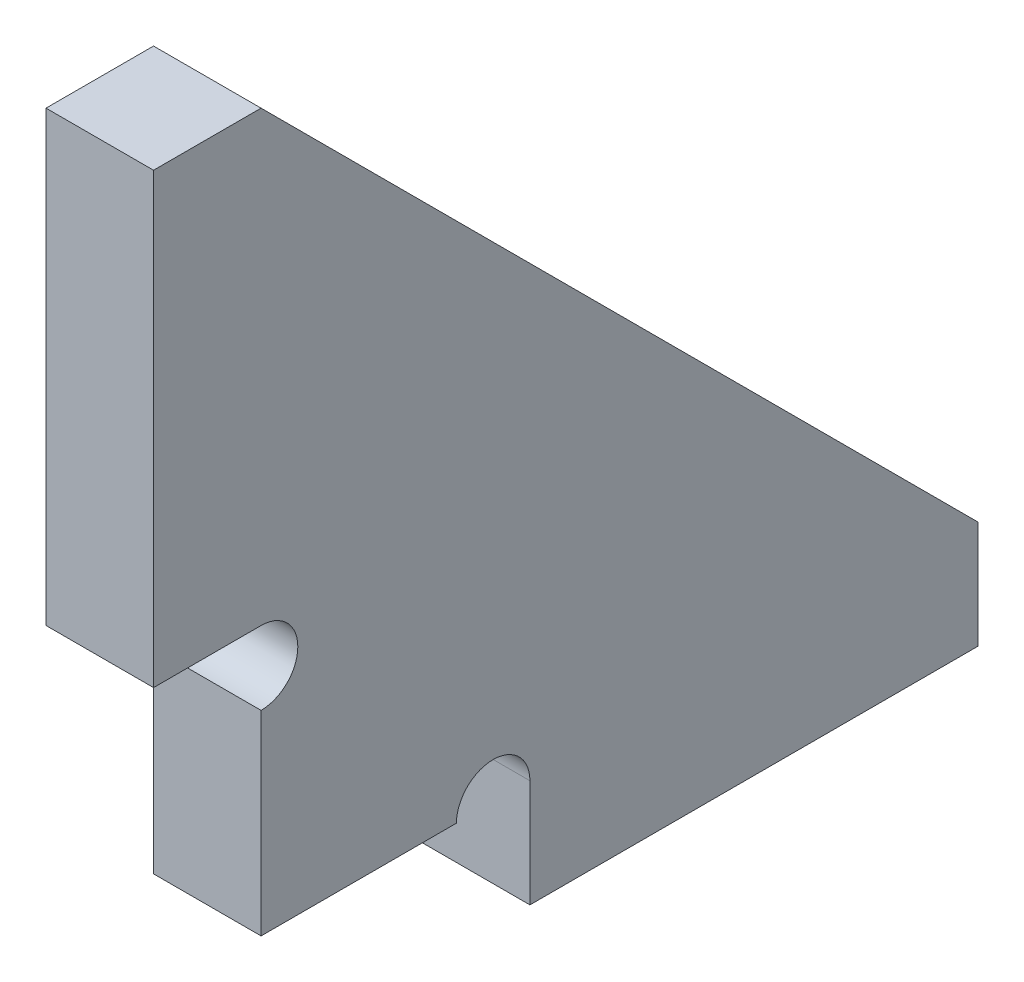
from build123d import *

# Parameters (mm, degrees)
BOSS_EXTRUDE1_DEPTH = 12


with BuildPart() as part:
    # Sketch1 → Boss-Extrude1 (new body)
    with BuildSketch(Plane(origin=(0, 0, 0), x_dir=(0, 0, -1), z_dir=(1, 0, 0))):
        with BuildLine():
            Line((0, 0), (-50, 0))
            Line((-50, 0), (-50, 12))
            ThreePointArc((-50, 12), (-54.1, 16.1), (-58.2, 12))
            Line((-58.2, 12), (-80, 12))
            Line((-80, 12), (-80, 33.8))
            ThreePointArc((-80, 33.8), (-75.9, 37.9), (-80, 42))
            Line((-80, 42), (-92, 42))
            Line((-92, 42), (-92, 92))
            Line((-92, 92), (-80, 92))
            Line((-80, 92), (0, 12))
            Line((0, 12), (0, 0))
        make_face()
    extrude(amount=BOSS_EXTRUDE1_DEPTH)


solid = part.part
